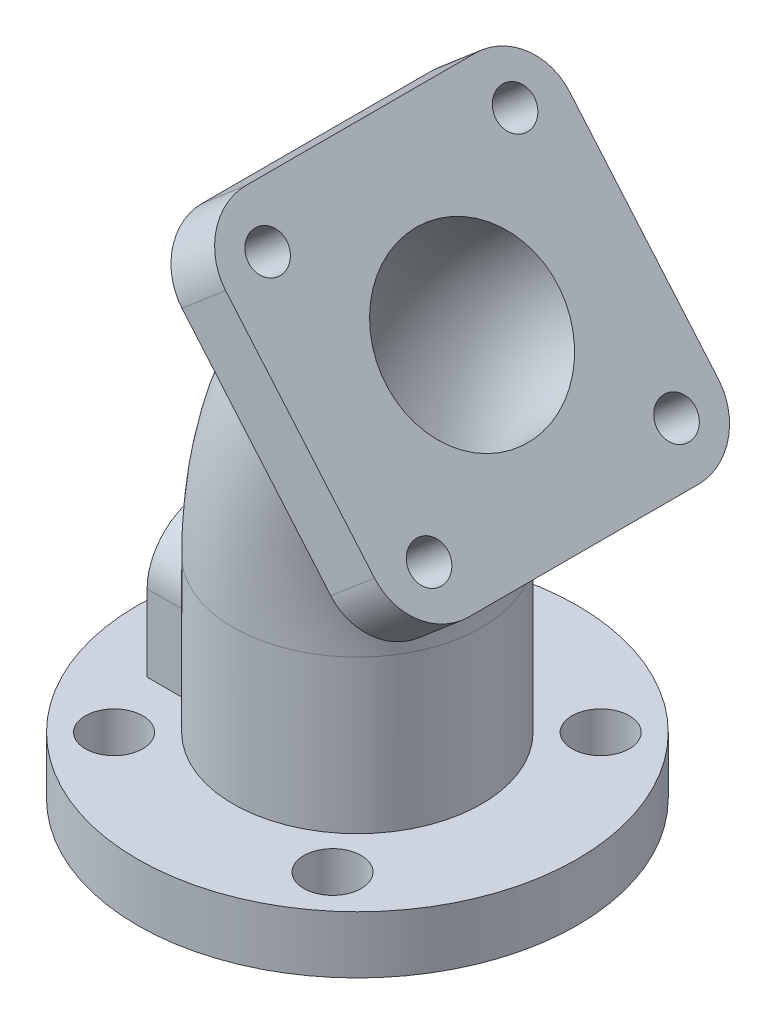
from build123d import *

# Parameters (mm, degrees)
SKETCH_1_R               = 13
SKETCH_1_R_2             = 9
EXTRUDE_START            = 6
SKETCH_5_R               = 23
SKETCH_5_R_2             = 13
EXTRUDE_2_DEPTH          = 6
SKETCH_6_R               = 12
EXTRUDE_3_DEPTH          = 6
CUT_EXTRUDE_1_REACH      = 70.353
SKETCH_9_R               = 2
EXTRUDE_4_REACH          = 78.876
EXTRUDE_4_END_RADIUS     = 13
CUT_EXTRUDE_2_REACH      = 78.876
CUT_EXTRUDE_2_END_RADIUS = 9
SKETCH_11_R              = 3
SKETCH_12_R              = 3
CUT_EXTRUDE_3_DEPTH      = 65.744028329


with BuildPart() as part:
    # Sweep 1: sweep along a path in Sketch 4
    with BuildLine(Plane.XY) as sweep_1_path:
        Line((0, 0), (0, 22))
        ThreePointArc((0, 22), (3.14472103, 36.317821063), (12, 48))
    # Sketch 1 → Sweep 1 (sweep)
    with BuildSketch(Plane(origin=(0, 0, 0), x_dir=(1, 0, 0), z_dir=(0, 1, 0))):
        Circle(SKETCH_1_R)
        Circle(SKETCH_1_R_2, mode=Mode.SUBTRACT)
    sweep(path=sweep_1_path.line)

    # Sketch 5 → Extrude 2 (add)
    with BuildSketch(Plane(origin=(0, 0, 0), x_dir=(1, 0, 0), z_dir=(0, 1, 0)).offset(EXTRUDE_START)):
        with Locations(Location((0, 0, 0), (0, 0, 270))):
            Circle(SKETCH_5_R)
        with Locations(Location((0, 0, 0), (0, 0, 180))):
            Circle(SKETCH_5_R_2, mode=Mode.SUBTRACT)
    extrude(amount=-EXTRUDE_2_DEPTH)

    # Sketch 6 → Extrude 3 (add)
    with BuildSketch(Plane(origin=(30.646900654, 26.128447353, 0), x_dir=(0, 0, -1), z_dir=(0.7609756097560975, 0.6487804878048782, 0))):
        with BuildLine():
            Line((-12, 46.74), (12, 46.74))
            ThreePointArc((12, 46.74), (16.242640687, 44.982640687), (18, 40.74))
            Line((18, 40.74), (18, 16.74))
            ThreePointArc((18, 16.74), (16.242640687, 12.497359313), (12, 10.74))
            Line((12, 10.74), (-12, 10.74))
            ThreePointArc((-12, 10.74), (-16.242640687, 12.497359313), (-18, 16.74))
            Line((-18, 16.74), (-18, 40.74))
            ThreePointArc((-18, 40.74), (-16.242640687, 44.982640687), (-12, 46.74))
        make_face()
        with Locations((0, 28.741463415)):
            Circle(SKETCH_6_R, mode=Mode.SUBTRACT)
    extrude(amount=-EXTRUDE_3_DEPTH)

    # Sketch 9 → Cut-Extrude 1 (cut, up to next)
    with BuildSketch(Plane(origin=(30.646900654, 26.128447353, 0), x_dir=(0, 0, -1), z_dir=(0.7609756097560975, 0.6487804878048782, 0)), mode=Mode.PRIVATE) as cut_extrude_1_sk1:
        with Locations(Location((12.933181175, 41.741463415, 0), (0, 0, 90))):
            Circle(SKETCH_9_R)
    cut_extrude_1_tool1 = extrude(cut_extrude_1_sk1.sketch, amount=-CUT_EXTRUDE_1_REACH, mode=Mode.PRIVATE) & part.part
    # Sketch 9 → Cut-Extrude 1 (cut, up to next)
    with BuildSketch(Plane(origin=(30.646900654, 26.128447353, 0), x_dir=(0, 0, -1), z_dir=(0.7609756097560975, 0.6487804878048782, 0)), mode=Mode.PRIVATE) as cut_extrude_1_sk2:
        with Locations(Location((-13, 41.67464459, 0), (0, 0, 90))):
            Circle(SKETCH_9_R)
    cut_extrude_1_tool2 = extrude(cut_extrude_1_sk2.sketch, amount=-CUT_EXTRUDE_1_REACH, mode=Mode.PRIVATE) & part.part
    # Sketch 9 → Cut-Extrude 1 (cut, up to next)
    with BuildSketch(Plane(origin=(30.646900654, 26.128447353, 0), x_dir=(0, 0, -1), z_dir=(0.7609756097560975, 0.6487804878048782, 0)), mode=Mode.PRIVATE) as cut_extrude_1_sk3:
        with Locations(Location((-12.933181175, 15.741463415, 0), (0, 0, 90))):
            Circle(SKETCH_9_R)
    cut_extrude_1_tool3 = extrude(cut_extrude_1_sk3.sketch, amount=-CUT_EXTRUDE_1_REACH, mode=Mode.PRIVATE) & part.part
    # Sketch 9 → Cut-Extrude 1 (cut, up to next)
    with BuildSketch(Plane(origin=(30.646900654, 26.128447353, 0), x_dir=(0, 0, -1), z_dir=(0.7609756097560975, 0.6487804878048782, 0)), mode=Mode.PRIVATE) as cut_extrude_1_sk4:
        with Locations(Location((13, 15.808282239, 0), (0, 0, 90))):
            Circle(SKETCH_9_R)
    cut_extrude_1_tool4 = extrude(cut_extrude_1_sk4.sketch, amount=-CUT_EXTRUDE_1_REACH, mode=Mode.PRIVATE) & part.part
    add(cut_extrude_1_tool1.solids().sort_by_distance((3.565854, 57.892683, -12.933181))[0], mode=Mode.SUBTRACT)
    add(cut_extrude_1_tool2.solids().sort_by_distance((3.609204, 57.841835, 13))[0], mode=Mode.SUBTRACT)
    add(cut_extrude_1_tool3.solids().sort_by_distance((20.434146, 38.107317, 12.933181))[0], mode=Mode.SUBTRACT)
    add(cut_extrude_1_tool4.solids().sort_by_distance((20.390796, 38.158165, -13))[0], mode=Mode.SUBTRACT)

    # Extrude 4: up to this cylinder (the profile starts outside it)
    extrude_4_end = Plane(origin=(0, 12.426732, 0), z_dir=(0, -1, 0)) * Cylinder(EXTRUDE_4_END_RADIUS, 184.752, mode=Mode.PRIVATE)
    # Sketch 10 → Extrude 4 (add, up to the surface)
    with BuildSketch(Plane(origin=(-16, 0, 0), x_dir=(0, 0, -1), z_dir=(1, 0, 0)), mode=Mode.PRIVATE) as extrude_4_sk1:
        with BuildLine():
            Line((-6, 6), (-6, 14))
            ThreePointArc((-6, 14), (0, 20), (6, 14))
            Line((6, 14), (6, 6))
            Line((6, 6), (-6, 6))
        make_face()
    extrude_4_tool1 = extrude(extrude_4_sk1.sketch, amount=EXTRUDE_4_REACH, mode=Mode.PRIVATE) - extrude_4_end
    add(extrude_4_tool1.solids().sort_by_distance((-16, 12.426732, 0))[0])

    # Cut-Extrude 2: up to this cylinder (the profile starts outside it)
    cut_extrude_2_end = Plane(origin=(0, 14, 0), z_dir=(0, -1, 0)) * Cylinder(CUT_EXTRUDE_2_END_RADIUS, 176.752, mode=Mode.PRIVATE)
    # Sketch 11 → Cut-Extrude 2 (cut, up to the surface)
    with BuildSketch(Plane.ZY.offset(16), mode=Mode.PRIVATE) as cut_extrude_2_sk1:
        with Locations((0, 14)):
            Circle(SKETCH_11_R)
    cut_extrude_2_tool1 = extrude(cut_extrude_2_sk1.sketch, amount=-CUT_EXTRUDE_2_REACH, mode=Mode.PRIVATE) - cut_extrude_2_end
    add(cut_extrude_2_tool1.solids().sort_by_distance((-16, 14, 0))[0], mode=Mode.SUBTRACT)

    # Sketch 12 → Cut-Extrude 3 (cut, through all)
    with BuildSketch(Plane(origin=(0, 6, 0), x_dir=(1, 0, 0), z_dir=(0, 1, 0))):
        with Locations(Location((12.727922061, 12.727922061, 0), (0, 0, 270))):
            Circle(SKETCH_12_R)
        with Locations(Location((-13.961897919, 11.360695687, 0), (0, 0, 270))):
            Circle(SKETCH_12_R)
        with Locations(Location((-12.727922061, -12.727922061, 0), (0, 0, 270))):
            Circle(SKETCH_12_R)
        with Locations(Location((11.360695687, -13.961897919, 0), (0, 0, 270))):
            Circle(SKETCH_12_R)
    extrude(amount=-CUT_EXTRUDE_3_DEPTH, mode=Mode.SUBTRACT)


solid = part.part
